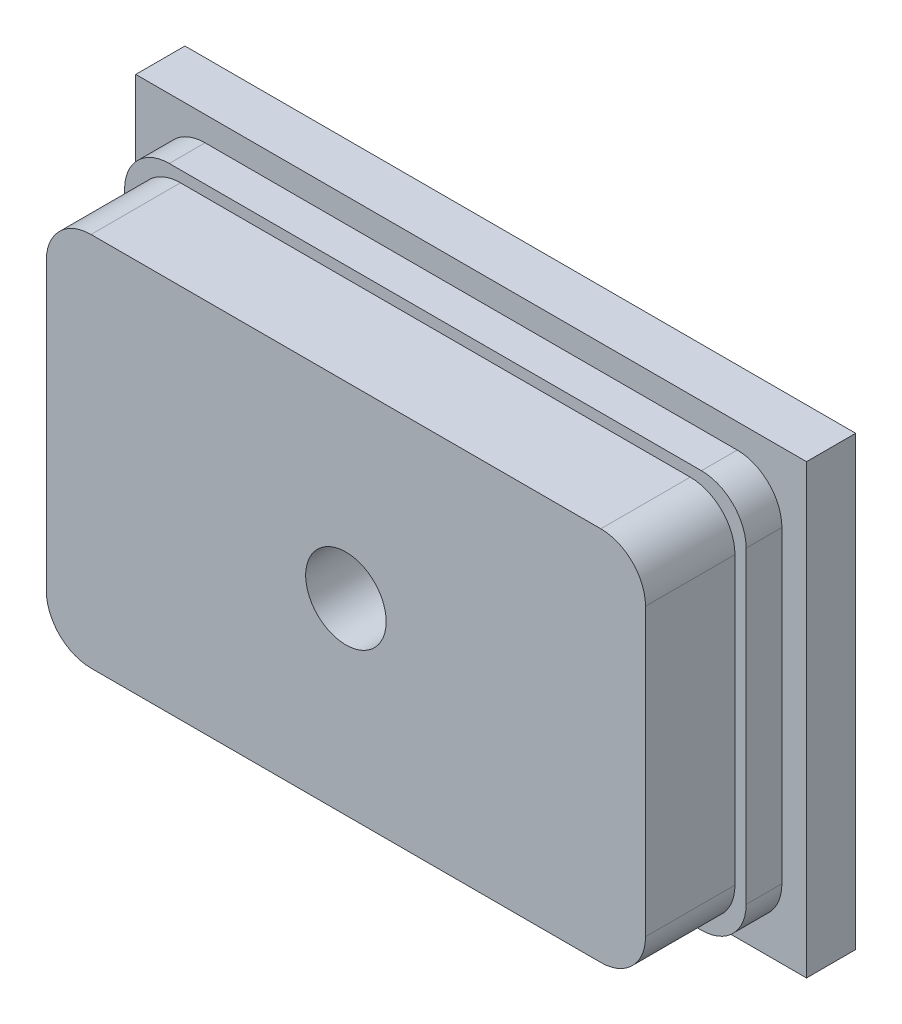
ISO-10303-21;
HEADER;
FILE_DESCRIPTION(('STEP AP214'),'2;1');
FILE_NAME('part.step','',(''),(''),'','','');
FILE_SCHEMA(('AUTOMOTIVE_DESIGN { 1 0 10303 214 1 1 1 1 }'));
ENDSEC;
DATA;
#1=APPLICATION_CONTEXT('core data for automotive mechanical design processes');
#2=APPLICATION_PROTOCOL_DEFINITION('international standard','automotive_design',2000,#1);
#3=PRODUCT_CONTEXT('',#1,'mechanical');
#4=PRODUCT('Part','Part','',(#3));
#5=PRODUCT_RELATED_PRODUCT_CATEGORY('part','',(#4));
#6=PRODUCT_DEFINITION_FORMATION('','',#4);
#7=PRODUCT_DEFINITION_CONTEXT('part definition',#1,'design');
#8=PRODUCT_DEFINITION('design','',#6,#7);
#9=PRODUCT_DEFINITION_SHAPE('','',#8);
#10=(LENGTH_UNIT() NAMED_UNIT(*) SI_UNIT(.MILLI.,.METRE.));
#11=(NAMED_UNIT(*) PLANE_ANGLE_UNIT() SI_UNIT($,.RADIAN.));
#12=(NAMED_UNIT(*) SI_UNIT($,.STERADIAN.) SOLID_ANGLE_UNIT());
#13=UNCERTAINTY_MEASURE_WITH_UNIT(LENGTH_MEASURE(1.E-05),#10,'distance_accuracy_value','');
#14=(GEOMETRIC_REPRESENTATION_CONTEXT(3) GLOBAL_UNCERTAINTY_ASSIGNED_CONTEXT((#13)) GLOBAL_UNIT_ASSIGNED_CONTEXT((#10,
#11,#12)) REPRESENTATION_CONTEXT('',''));
#15=CARTESIAN_POINT('',(0.,0.,0.));
#16=DIRECTION('',(0.,0.,1.));
#17=DIRECTION('',(1.,0.,0.));
#18=AXIS2_PLACEMENT_3D('',#15,#16,#17);
#19=CARTESIAN_POINT('',(-69.5,44.5,8.));
#20=DIRECTION('',(0.,0.,-1.));
#21=DIRECTION('',(-1.,0.,0.));
#22=AXIS2_PLACEMENT_3D('',#19,#20,#21);
#23=PLANE('',#22);
#24=DIRECTION('',(0.,1.,0.));
#25=VECTOR('',#24,1.);
#26=CARTESIAN_POINT('',(69.5,-44.5,8.));
#27=LINE('',#26,#25);
#28=CARTESIAN_POINT('',(69.5,-34.5,8.));
#29=VERTEX_POINT('',#28);
#30=CARTESIAN_POINT('',(69.5,34.5,8.));
#31=VERTEX_POINT('',#30);
#32=EDGE_CURVE('E256',#29,#31,#27,.T.);
#33=ORIENTED_EDGE('',*,*,#32,.T.);
#34=CARTESIAN_POINT('',(59.5,34.5,8.));
#35=DIRECTION('',(0.,0.,-1.));
#36=DIRECTION('',(-1.,0.,0.));
#37=AXIS2_PLACEMENT_3D('',#34,#35,#36);
#38=CIRCLE('',#37,10.);
#39=CARTESIAN_POINT('',(59.5,44.5,8.));
#40=VERTEX_POINT('',#39);
#41=EDGE_CURVE('E325',#31,#40,#38,.F.);
#42=ORIENTED_EDGE('',*,*,#41,.T.);
#43=DIRECTION('',(-1.,0.,0.));
#44=VECTOR('',#43,1.);
#45=CARTESIAN_POINT('',(-69.5,44.5,8.));
#46=LINE('',#45,#44);
#47=CARTESIAN_POINT('',(-59.5,44.5,8.));
#48=VERTEX_POINT('',#47);
#49=EDGE_CURVE('E259',#40,#48,#46,.T.);
#50=ORIENTED_EDGE('',*,*,#49,.T.);
#51=CARTESIAN_POINT('',(-59.5,34.5,8.));
#52=DIRECTION('',(0.,0.,-1.));
#53=DIRECTION('',(-1.,0.,0.));
#54=AXIS2_PLACEMENT_3D('',#51,#52,#53);
#55=CIRCLE('',#54,10.);
#56=CARTESIAN_POINT('',(-69.5,34.5,8.));
#57=VERTEX_POINT('',#56);
#58=EDGE_CURVE('E321',#48,#57,#55,.F.);
#59=ORIENTED_EDGE('',*,*,#58,.T.);
#60=DIRECTION('',(0.,-1.,0.));
#61=VECTOR('',#60,1.);
#62=CARTESIAN_POINT('',(-69.5,-44.5,8.));
#63=LINE('',#62,#61);
#64=CARTESIAN_POINT('',(-69.5,-34.5,8.));
#65=VERTEX_POINT('',#64);
#66=EDGE_CURVE('E252',#57,#65,#63,.T.);
#67=ORIENTED_EDGE('',*,*,#66,.T.);
#68=CARTESIAN_POINT('',(-59.5,-34.5,8.));
#69=DIRECTION('',(0.,0.,-1.));
#70=DIRECTION('',(-1.,0.,0.));
#71=AXIS2_PLACEMENT_3D('',#68,#69,#70);
#72=CIRCLE('',#71,10.);
#73=CARTESIAN_POINT('',(-59.5,-44.5,8.));
#74=VERTEX_POINT('',#73);
#75=EDGE_CURVE('E57',#65,#74,#72,.F.);
#76=ORIENTED_EDGE('',*,*,#75,.T.);
#77=DIRECTION('',(1.,0.,0.));
#78=VECTOR('',#77,1.);
#79=CARTESIAN_POINT('',(-69.5,-44.5,8.));
#80=LINE('',#79,#78);
#81=CARTESIAN_POINT('',(59.5,-44.5,8.));
#82=VERTEX_POINT('',#81);
#83=EDGE_CURVE('E254',#74,#82,#80,.T.);
#84=ORIENTED_EDGE('',*,*,#83,.T.);
#85=CARTESIAN_POINT('',(59.5,-34.5,8.));
#86=DIRECTION('',(0.,0.,-1.));
#87=DIRECTION('',(-1.,0.,0.));
#88=AXIS2_PLACEMENT_3D('',#85,#86,#87);
#89=CIRCLE('',#88,10.);
#90=EDGE_CURVE('E323',#82,#29,#89,.F.);
#91=ORIENTED_EDGE('',*,*,#90,.T.);
#92=EDGE_LOOP('',(#33,#42,#50,#59,#67,#76,#84,#91));
#93=FACE_BOUND('',#92,.T.);
#94=DIRECTION('',(0.,-1.,0.));
#95=VECTOR('',#94,1.);
#96=CARTESIAN_POINT('',(-67.,42.,8.));
#97=LINE('',#96,#95);
#98=CARTESIAN_POINT('',(-67.,32.,8.));
#99=VERTEX_POINT('',#98);
#100=CARTESIAN_POINT('',(-67.,-32.,8.));
#101=VERTEX_POINT('',#100);
#102=EDGE_CURVE('E191',#99,#101,#97,.T.);
#103=ORIENTED_EDGE('',*,*,#102,.F.);
#104=CARTESIAN_POINT('',(-57.,32.,8.));
#105=DIRECTION('',(0.,0.,-1.));
#106=DIRECTION('',(-1.,0.,0.));
#107=AXIS2_PLACEMENT_3D('',#104,#105,#106);
#108=CIRCLE('',#107,10.);
#109=CARTESIAN_POINT('',(-57.,42.,8.));
#110=VERTEX_POINT('',#109);
#111=EDGE_CURVE('E290',#99,#110,#108,.T.);
#112=ORIENTED_EDGE('',*,*,#111,.T.);
#113=DIRECTION('',(-1.,0.,0.));
#114=VECTOR('',#113,1.);
#115=CARTESIAN_POINT('',(-67.,42.,8.));
#116=LINE('',#115,#114);
#117=CARTESIAN_POINT('',(57.,42.,8.));
#118=VERTEX_POINT('',#117);
#119=EDGE_CURVE('E228',#118,#110,#116,.T.);
#120=ORIENTED_EDGE('',*,*,#119,.F.);
#121=CARTESIAN_POINT('',(57.,32.,8.));
#122=DIRECTION('',(0.,0.,-1.));
#123=DIRECTION('',(-1.,0.,0.));
#124=AXIS2_PLACEMENT_3D('',#121,#122,#123);
#125=CIRCLE('',#124,10.);
#126=CARTESIAN_POINT('',(67.,32.,8.));
#127=VERTEX_POINT('',#126);
#128=EDGE_CURVE('E294',#118,#127,#125,.T.);
#129=ORIENTED_EDGE('',*,*,#128,.T.);
#130=DIRECTION('',(0.,1.,0.));
#131=VECTOR('',#130,1.);
#132=CARTESIAN_POINT('',(67.,42.,8.));
#133=LINE('',#132,#131);
#134=CARTESIAN_POINT('',(67.,-32.,8.));
#135=VERTEX_POINT('',#134);
#136=EDGE_CURVE('E225',#135,#127,#133,.T.);
#137=ORIENTED_EDGE('',*,*,#136,.F.);
#138=CARTESIAN_POINT('',(57.,-32.,8.));
#139=DIRECTION('',(0.,0.,-1.));
#140=DIRECTION('',(-1.,0.,0.));
#141=AXIS2_PLACEMENT_3D('',#138,#139,#140);
#142=CIRCLE('',#141,10.);
#143=CARTESIAN_POINT('',(57.,-42.,8.));
#144=VERTEX_POINT('',#143);
#145=EDGE_CURVE('E296',#135,#144,#142,.T.);
#146=ORIENTED_EDGE('',*,*,#145,.T.);
#147=DIRECTION('',(1.,0.,0.));
#148=VECTOR('',#147,1.);
#149=CARTESIAN_POINT('',(-67.,-42.,8.));
#150=LINE('',#149,#148);
#151=CARTESIAN_POINT('',(-57.,-42.,8.));
#152=VERTEX_POINT('',#151);
#153=EDGE_CURVE('E222',#152,#144,#150,.T.);
#154=ORIENTED_EDGE('',*,*,#153,.F.);
#155=CARTESIAN_POINT('',(-57.,-32.,8.));
#156=DIRECTION('',(0.,0.,-1.));
#157=DIRECTION('',(-1.,0.,0.));
#158=AXIS2_PLACEMENT_3D('',#155,#156,#157);
#159=CIRCLE('',#158,10.);
#160=EDGE_CURVE('E292',#152,#101,#159,.T.);
#161=ORIENTED_EDGE('',*,*,#160,.T.);
#162=EDGE_LOOP('',(#103,#112,#120,#129,#137,#146,#154,#161));
#163=FACE_BOUND('',#162,.T.);
#164=ADVANCED_FACE('F35',(#93,#163),#23,.F.);
#165=CARTESIAN_POINT('',(-69.5,-44.5,8.));
#166=DIRECTION('',(1.,0.,0.));
#167=DIRECTION('',(0.,0.,-1.));
#168=AXIS2_PLACEMENT_3D('',#165,#166,#167);
#169=PLANE('',#168);
#170=ORIENTED_EDGE('',*,*,#66,.F.);
#171=DIRECTION('',(0.,0.,-1.));
#172=VECTOR('',#171,1.);
#173=CARTESIAN_POINT('',(-69.5,34.5,8.));
#174=LINE('',#173,#172);
#175=CARTESIAN_POINT('',(-69.5,34.5,0.));
#176=VERTEX_POINT('',#175);
#177=EDGE_CURVE('E11',#57,#176,#174,.T.);
#178=ORIENTED_EDGE('',*,*,#177,.T.);
#179=DIRECTION('',(0.,-1.,0.));
#180=VECTOR('',#179,1.);
#181=CARTESIAN_POINT('',(-69.5,-44.5,0.));
#182=LINE('',#181,#180);
#183=CARTESIAN_POINT('',(-69.5,-34.5,0.));
#184=VERTEX_POINT('',#183);
#185=EDGE_CURVE('E243',#176,#184,#182,.T.);
#186=ORIENTED_EDGE('',*,*,#185,.T.);
#187=DIRECTION('',(0.,0.,-1.));
#188=VECTOR('',#187,1.);
#189=CARTESIAN_POINT('',(-69.5,-34.5,8.));
#190=LINE('',#189,#188);
#191=EDGE_CURVE('E43',#184,#65,#190,.F.);
#192=ORIENTED_EDGE('',*,*,#191,.T.);
#193=EDGE_LOOP('',(#170,#178,#186,#192));
#194=FACE_BOUND('',#193,.T.);
#195=ADVANCED_FACE('F37',(#194),#169,.F.);
#196=CARTESIAN_POINT('',(-69.5,-44.5,8.));
#197=DIRECTION('',(0.,1.,0.));
#198=DIRECTION('',(0.,0.,1.));
#199=AXIS2_PLACEMENT_3D('',#196,#197,#198);
#200=PLANE('',#199);
#201=DIRECTION('',(1.,0.,0.));
#202=VECTOR('',#201,1.);
#203=CARTESIAN_POINT('',(-69.5,-44.5,0.));
#204=LINE('',#203,#202);
#205=CARTESIAN_POINT('',(-59.5,-44.5,0.));
#206=VERTEX_POINT('',#205);
#207=CARTESIAN_POINT('',(59.5,-44.5,0.));
#208=VERTEX_POINT('',#207);
#209=EDGE_CURVE('E246',#206,#208,#204,.T.);
#210=ORIENTED_EDGE('',*,*,#209,.T.);
#211=DIRECTION('',(0.,0.,-1.));
#212=VECTOR('',#211,1.);
#213=CARTESIAN_POINT('',(59.5,-44.5,8.));
#214=LINE('',#213,#212);
#215=EDGE_CURVE('E50',#208,#82,#214,.F.);
#216=ORIENTED_EDGE('',*,*,#215,.T.);
#217=ORIENTED_EDGE('',*,*,#83,.F.);
#218=DIRECTION('',(0.,0.,-1.));
#219=VECTOR('',#218,1.);
#220=CARTESIAN_POINT('',(-59.5,-44.5,8.));
#221=LINE('',#220,#219);
#222=EDGE_CURVE('E327',#74,#206,#221,.T.);
#223=ORIENTED_EDGE('',*,*,#222,.T.);
#224=EDGE_LOOP('',(#210,#216,#217,#223));
#225=FACE_BOUND('',#224,.T.);
#226=ADVANCED_FACE('F340',(#225),#200,.F.);
#227=CARTESIAN_POINT('',(69.5,-44.5,8.));
#228=DIRECTION('',(-1.,0.,0.));
#229=DIRECTION('',(0.,0.,1.));
#230=AXIS2_PLACEMENT_3D('',#227,#228,#229);
#231=PLANE('',#230);
#232=DIRECTION('',(0.,1.,0.));
#233=VECTOR('',#232,1.);
#234=CARTESIAN_POINT('',(69.5,-44.5,0.));
#235=LINE('',#234,#233);
#236=CARTESIAN_POINT('',(69.5,-34.5,0.));
#237=VERTEX_POINT('',#236);
#238=CARTESIAN_POINT('',(69.5,34.5,0.));
#239=VERTEX_POINT('',#238);
#240=EDGE_CURVE('E248',#237,#239,#235,.T.);
#241=ORIENTED_EDGE('',*,*,#240,.T.);
#242=DIRECTION('',(0.,0.,-1.));
#243=VECTOR('',#242,1.);
#244=CARTESIAN_POINT('',(69.5,34.5,8.));
#245=LINE('',#244,#243);
#246=EDGE_CURVE('E318',#239,#31,#245,.F.);
#247=ORIENTED_EDGE('',*,*,#246,.T.);
#248=ORIENTED_EDGE('',*,*,#32,.F.);
#249=DIRECTION('',(0.,0.,-1.));
#250=VECTOR('',#249,1.);
#251=CARTESIAN_POINT('',(69.5,-34.5,8.));
#252=LINE('',#251,#250);
#253=EDGE_CURVE('E315',#29,#237,#252,.T.);
#254=ORIENTED_EDGE('',*,*,#253,.T.);
#255=EDGE_LOOP('',(#241,#247,#248,#254));
#256=FACE_BOUND('',#255,.T.);
#257=ADVANCED_FACE('F349',(#256),#231,.F.);
#258=CARTESIAN_POINT('',(-69.5,44.5,8.));
#259=DIRECTION('',(0.,-1.,0.));
#260=DIRECTION('',(0.,0.,-1.));
#261=AXIS2_PLACEMENT_3D('',#258,#259,#260);
#262=PLANE('',#261);
#263=ORIENTED_EDGE('',*,*,#49,.F.);
#264=DIRECTION('',(0.,0.,-1.));
#265=VECTOR('',#264,1.);
#266=CARTESIAN_POINT('',(59.5,44.5,8.));
#267=LINE('',#266,#265);
#268=CARTESIAN_POINT('',(59.5,44.5,0.));
#269=VERTEX_POINT('',#268);
#270=EDGE_CURVE('E300',#40,#269,#267,.T.);
#271=ORIENTED_EDGE('',*,*,#270,.T.);
#272=DIRECTION('',(-1.,0.,0.));
#273=VECTOR('',#272,1.);
#274=CARTESIAN_POINT('',(-69.5,44.5,0.));
#275=LINE('',#274,#273);
#276=CARTESIAN_POINT('',(-59.5,44.5,0.));
#277=VERTEX_POINT('',#276);
#278=EDGE_CURVE('E250',#269,#277,#275,.T.);
#279=ORIENTED_EDGE('',*,*,#278,.T.);
#280=DIRECTION('',(0.,0.,-1.));
#281=VECTOR('',#280,1.);
#282=CARTESIAN_POINT('',(-59.5,44.5,8.));
#283=LINE('',#282,#281);
#284=EDGE_CURVE('E298',#277,#48,#283,.F.);
#285=ORIENTED_EDGE('',*,*,#284,.T.);
#286=EDGE_LOOP('',(#263,#271,#279,#285));
#287=FACE_BOUND('',#286,.T.);
#288=ADVANCED_FACE('F358',(#287),#262,.F.);
#289=CARTESIAN_POINT('',(-67.,42.,28.));
#290=DIRECTION('',(1.,0.,0.));
#291=DIRECTION('',(0.,1.,0.));
#292=AXIS2_PLACEMENT_3D('',#289,#290,#291);
#293=PLANE('',#292);
#294=DIRECTION('',(0.,-1.,0.));
#295=VECTOR('',#294,1.);
#296=CARTESIAN_POINT('',(-67.,42.,28.));
#297=LINE('',#296,#295);
#298=CARTESIAN_POINT('',(-67.,32.,28.));
#299=VERTEX_POINT('',#298);
#300=CARTESIAN_POINT('',(-67.,-32.,28.));
#301=VERTEX_POINT('',#300);
#302=EDGE_CURVE('E231',#299,#301,#297,.T.);
#303=ORIENTED_EDGE('',*,*,#302,.F.);
#304=DIRECTION('',(0.,0.,-1.));
#305=VECTOR('',#304,1.);
#306=CARTESIAN_POINT('',(-67.,32.,28.));
#307=LINE('',#306,#305);
#308=EDGE_CURVE('E264',#299,#99,#307,.T.);
#309=ORIENTED_EDGE('',*,*,#308,.T.);
#310=ORIENTED_EDGE('',*,*,#102,.T.);
#311=DIRECTION('',(0.,0.,-1.));
#312=VECTOR('',#311,1.);
#313=CARTESIAN_POINT('',(-67.,-32.,28.));
#314=LINE('',#313,#312);
#315=EDGE_CURVE('E262',#101,#301,#314,.F.);
#316=ORIENTED_EDGE('',*,*,#315,.T.);
#317=EDGE_LOOP('',(#303,#309,#310,#316));
#318=FACE_BOUND('',#317,.T.);
#319=ADVANCED_FACE('F377',(#318),#293,.F.);
#320=CARTESIAN_POINT('',(-67.,-42.,28.));
#321=DIRECTION('',(0.,1.,0.));
#322=DIRECTION('',(-1.,0.,0.));
#323=AXIS2_PLACEMENT_3D('',#320,#321,#322);
#324=PLANE('',#323);
#325=DIRECTION('',(1.,0.,0.));
#326=VECTOR('',#325,1.);
#327=CARTESIAN_POINT('',(-67.,-42.,28.));
#328=LINE('',#327,#326);
#329=CARTESIAN_POINT('',(-57.,-42.,28.));
#330=VERTEX_POINT('',#329);
#331=CARTESIAN_POINT('',(57.,-42.,28.));
#332=VERTEX_POINT('',#331);
#333=EDGE_CURVE('E234',#330,#332,#328,.T.);
#334=ORIENTED_EDGE('',*,*,#333,.F.);
#335=DIRECTION('',(0.,0.,-1.));
#336=VECTOR('',#335,1.);
#337=CARTESIAN_POINT('',(-57.,-42.,28.));
#338=LINE('',#337,#336);
#339=EDGE_CURVE('E282',#330,#152,#338,.T.);
#340=ORIENTED_EDGE('',*,*,#339,.T.);
#341=ORIENTED_EDGE('',*,*,#153,.T.);
#342=DIRECTION('',(0.,0.,-1.));
#343=VECTOR('',#342,1.);
#344=CARTESIAN_POINT('',(57.,-42.,28.));
#345=LINE('',#344,#343);
#346=EDGE_CURVE('E280',#144,#332,#345,.F.);
#347=ORIENTED_EDGE('',*,*,#346,.T.);
#348=EDGE_LOOP('',(#334,#340,#341,#347));
#349=FACE_BOUND('',#348,.T.);
#350=ADVANCED_FACE('F402',(#349),#324,.F.);
#351=CARTESIAN_POINT('',(67.,42.,28.));
#352=DIRECTION('',(-1.,0.,0.));
#353=DIRECTION('',(0.,-1.,0.));
#354=AXIS2_PLACEMENT_3D('',#351,#352,#353);
#355=PLANE('',#354);
#356=ORIENTED_EDGE('',*,*,#136,.T.);
#357=DIRECTION('',(0.,0.,-1.));
#358=VECTOR('',#357,1.);
#359=CARTESIAN_POINT('',(67.,32.,28.));
#360=LINE('',#359,#358);
#361=CARTESIAN_POINT('',(67.,32.,28.));
#362=VERTEX_POINT('',#361);
#363=EDGE_CURVE('E288',#127,#362,#360,.F.);
#364=ORIENTED_EDGE('',*,*,#363,.T.);
#365=DIRECTION('',(0.,1.,0.));
#366=VECTOR('',#365,1.);
#367=CARTESIAN_POINT('',(67.,42.,28.));
#368=LINE('',#367,#366);
#369=CARTESIAN_POINT('',(67.,-32.,28.));
#370=VERTEX_POINT('',#369);
#371=EDGE_CURVE('E237',#370,#362,#368,.T.);
#372=ORIENTED_EDGE('',*,*,#371,.F.);
#373=DIRECTION('',(0.,0.,-1.));
#374=VECTOR('',#373,1.);
#375=CARTESIAN_POINT('',(67.,-32.,28.));
#376=LINE('',#375,#374);
#377=EDGE_CURVE('E285',#370,#135,#376,.T.);
#378=ORIENTED_EDGE('',*,*,#377,.T.);
#379=EDGE_LOOP('',(#356,#364,#372,#378));
#380=FACE_BOUND('',#379,.T.);
#381=ADVANCED_FACE('F409',(#380),#355,.F.);
#382=CARTESIAN_POINT('',(-67.,42.,28.));
#383=DIRECTION('',(0.,-1.,0.));
#384=DIRECTION('',(0.,0.,-1.));
#385=AXIS2_PLACEMENT_3D('',#382,#383,#384);
#386=PLANE('',#385);
#387=ORIENTED_EDGE('',*,*,#119,.T.);
#388=DIRECTION('',(0.,0.,-1.));
#389=VECTOR('',#388,1.);
#390=CARTESIAN_POINT('',(-57.,42.,28.));
#391=LINE('',#390,#389);
#392=CARTESIAN_POINT('',(-57.,42.,28.));
#393=VERTEX_POINT('',#392);
#394=EDGE_CURVE('E270',#110,#393,#391,.F.);
#395=ORIENTED_EDGE('',*,*,#394,.T.);
#396=DIRECTION('',(-1.,0.,0.));
#397=VECTOR('',#396,1.);
#398=CARTESIAN_POINT('',(-67.,42.,28.));
#399=LINE('',#398,#397);
#400=CARTESIAN_POINT('',(57.,42.,28.));
#401=VERTEX_POINT('',#400);
#402=EDGE_CURVE('E240',#401,#393,#399,.T.);
#403=ORIENTED_EDGE('',*,*,#402,.F.);
#404=DIRECTION('',(0.,0.,-1.));
#405=VECTOR('',#404,1.);
#406=CARTESIAN_POINT('',(57.,42.,28.));
#407=LINE('',#406,#405);
#408=EDGE_CURVE('E267',#401,#118,#407,.T.);
#409=ORIENTED_EDGE('',*,*,#408,.T.);
#410=EDGE_LOOP('',(#387,#395,#403,#409));
#411=FACE_BOUND('',#410,.T.);
#412=ADVANCED_FACE('F416',(#411),#386,.F.);
#413=CARTESIAN_POINT('',(-67.,42.,28.));
#414=DIRECTION('',(0.,0.,1.));
#415=DIRECTION('',(1.,0.,0.));
#416=AXIS2_PLACEMENT_3D('',#413,#414,#415);
#417=PLANE('',#416);
#418=CARTESIAN_POINT('',(0.,0.,28.));
#419=DIRECTION('',(0.,0.,1.));
#420=DIRECTION('',(1.,0.,0.));
#421=AXIS2_PLACEMENT_3D('',#418,#419,#420);
#422=CIRCLE('',#421,9.);
#423=CARTESIAN_POINT('',(9.,0.,28.));
#424=VERTEX_POINT('',#423);
#425=EDGE_CURVE('E201',#424,#424,#422,.T.);
#426=ORIENTED_EDGE('',*,*,#425,.F.);
#427=EDGE_LOOP('',(#426));
#428=FACE_BOUND('',#427,.T.);
#429=ORIENTED_EDGE('',*,*,#402,.T.);
#430=CARTESIAN_POINT('',(-57.,32.,28.));
#431=DIRECTION('',(0.,0.,1.));
#432=DIRECTION('',(1.,0.,0.));
#433=AXIS2_PLACEMENT_3D('',#430,#431,#432);
#434=CIRCLE('',#433,10.);
#435=EDGE_CURVE('E278',#393,#299,#434,.T.);
#436=ORIENTED_EDGE('',*,*,#435,.T.);
#437=ORIENTED_EDGE('',*,*,#302,.T.);
#438=CARTESIAN_POINT('',(-57.,-32.,28.));
#439=DIRECTION('',(0.,0.,1.));
#440=DIRECTION('',(1.,0.,0.));
#441=AXIS2_PLACEMENT_3D('',#438,#439,#440);
#442=CIRCLE('',#441,10.);
#443=EDGE_CURVE('E276',#301,#330,#442,.T.);
#444=ORIENTED_EDGE('',*,*,#443,.T.);
#445=ORIENTED_EDGE('',*,*,#333,.T.);
#446=CARTESIAN_POINT('',(57.,-32.,28.));
#447=DIRECTION('',(0.,0.,1.));
#448=DIRECTION('',(1.,0.,0.));
#449=AXIS2_PLACEMENT_3D('',#446,#447,#448);
#450=CIRCLE('',#449,10.);
#451=EDGE_CURVE('E272',#332,#370,#450,.T.);
#452=ORIENTED_EDGE('',*,*,#451,.T.);
#453=ORIENTED_EDGE('',*,*,#371,.T.);
#454=CARTESIAN_POINT('',(57.,32.,28.));
#455=DIRECTION('',(0.,0.,1.));
#456=DIRECTION('',(1.,0.,0.));
#457=AXIS2_PLACEMENT_3D('',#454,#455,#456);
#458=CIRCLE('',#457,10.);
#459=EDGE_CURVE('E274',#362,#401,#458,.T.);
#460=ORIENTED_EDGE('',*,*,#459,.T.);
#461=EDGE_LOOP('',(#429,#436,#437,#444,#445,#452,#453,#460));
#462=FACE_BOUND('',#461,.T.);
#463=ADVANCED_FACE('F424',(#428,#462),#417,.T.);
#464=CARTESIAN_POINT('',(-57.,32.,28.));
#465=DIRECTION('',(0.,0.,-1.));
#466=DIRECTION('',(-1.,0.,0.));
#467=AXIS2_PLACEMENT_3D('',#464,#465,#466);
#468=CYLINDRICAL_SURFACE('',#467,10.);
#469=ORIENTED_EDGE('',*,*,#435,.F.);
#470=ORIENTED_EDGE('',*,*,#394,.F.);
#471=ORIENTED_EDGE('',*,*,#111,.F.);
#472=ORIENTED_EDGE('',*,*,#308,.F.);
#473=EDGE_LOOP('',(#469,#470,#471,#472));
#474=FACE_BOUND('',#473,.T.);
#475=ADVANCED_FACE('F433',(#474),#468,.T.);
#476=CARTESIAN_POINT('',(-57.,-32.,28.));
#477=DIRECTION('',(0.,0.,-1.));
#478=DIRECTION('',(-1.,0.,0.));
#479=AXIS2_PLACEMENT_3D('',#476,#477,#478);
#480=CYLINDRICAL_SURFACE('',#479,10.);
#481=ORIENTED_EDGE('',*,*,#443,.F.);
#482=ORIENTED_EDGE('',*,*,#315,.F.);
#483=ORIENTED_EDGE('',*,*,#160,.F.);
#484=ORIENTED_EDGE('',*,*,#339,.F.);
#485=EDGE_LOOP('',(#481,#482,#483,#484));
#486=FACE_BOUND('',#485,.T.);
#487=ADVANCED_FACE('F442',(#486),#480,.T.);
#488=CARTESIAN_POINT('',(57.,32.,28.));
#489=DIRECTION('',(0.,0.,-1.));
#490=DIRECTION('',(-1.,0.,0.));
#491=AXIS2_PLACEMENT_3D('',#488,#489,#490);
#492=CYLINDRICAL_SURFACE('',#491,10.);
#493=ORIENTED_EDGE('',*,*,#459,.F.);
#494=ORIENTED_EDGE('',*,*,#363,.F.);
#495=ORIENTED_EDGE('',*,*,#128,.F.);
#496=ORIENTED_EDGE('',*,*,#408,.F.);
#497=EDGE_LOOP('',(#493,#494,#495,#496));
#498=FACE_BOUND('',#497,.T.);
#499=ADVANCED_FACE('F450',(#498),#492,.T.);
#500=CARTESIAN_POINT('',(57.,-32.,28.));
#501=DIRECTION('',(0.,0.,-1.));
#502=DIRECTION('',(-1.,0.,0.));
#503=AXIS2_PLACEMENT_3D('',#500,#501,#502);
#504=CYLINDRICAL_SURFACE('',#503,10.);
#505=ORIENTED_EDGE('',*,*,#451,.F.);
#506=ORIENTED_EDGE('',*,*,#346,.F.);
#507=ORIENTED_EDGE('',*,*,#145,.F.);
#508=ORIENTED_EDGE('',*,*,#377,.F.);
#509=EDGE_LOOP('',(#505,#506,#507,#508));
#510=FACE_BOUND('',#509,.T.);
#511=ADVANCED_FACE('F458',(#510),#504,.T.);
#512=CARTESIAN_POINT('',(59.5,34.5,8.));
#513=DIRECTION('',(0.,0.,-1.));
#514=DIRECTION('',(-1.,0.,0.));
#515=AXIS2_PLACEMENT_3D('',#512,#513,#514);
#516=CYLINDRICAL_SURFACE('',#515,10.);
#517=ORIENTED_EDGE('',*,*,#41,.F.);
#518=ORIENTED_EDGE('',*,*,#246,.F.);
#519=CARTESIAN_POINT('',(59.5,34.5,0.));
#520=DIRECTION('',(0.,0.,-1.));
#521=DIRECTION('',(-1.,0.,0.));
#522=AXIS2_PLACEMENT_3D('',#519,#520,#521);
#523=CIRCLE('',#522,10.);
#524=EDGE_CURVE('E312',#269,#239,#523,.T.);
#525=ORIENTED_EDGE('',*,*,#524,.F.);
#526=ORIENTED_EDGE('',*,*,#270,.F.);
#527=EDGE_LOOP('',(#517,#518,#525,#526));
#528=FACE_BOUND('',#527,.T.);
#529=ADVANCED_FACE('F355',(#528),#516,.T.);
#530=CARTESIAN_POINT('',(59.5,-34.5,8.));
#531=DIRECTION('',(0.,0.,-1.));
#532=DIRECTION('',(-1.,0.,0.));
#533=AXIS2_PLACEMENT_3D('',#530,#531,#532);
#534=CYLINDRICAL_SURFACE('',#533,10.);
#535=ORIENTED_EDGE('',*,*,#90,.F.);
#536=ORIENTED_EDGE('',*,*,#215,.F.);
#537=CARTESIAN_POINT('',(59.5,-34.5,0.));
#538=DIRECTION('',(0.,0.,-1.));
#539=DIRECTION('',(-1.,0.,0.));
#540=AXIS2_PLACEMENT_3D('',#537,#538,#539);
#541=CIRCLE('',#540,10.);
#542=EDGE_CURVE('E309',#237,#208,#541,.T.);
#543=ORIENTED_EDGE('',*,*,#542,.F.);
#544=ORIENTED_EDGE('',*,*,#253,.F.);
#545=EDGE_LOOP('',(#535,#536,#543,#544));
#546=FACE_BOUND('',#545,.T.);
#547=ADVANCED_FACE('F346',(#546),#534,.T.);
#548=CARTESIAN_POINT('',(-59.5,34.5,8.));
#549=DIRECTION('',(0.,0.,-1.));
#550=DIRECTION('',(-1.,0.,0.));
#551=AXIS2_PLACEMENT_3D('',#548,#549,#550);
#552=CYLINDRICAL_SURFACE('',#551,10.);
#553=ORIENTED_EDGE('',*,*,#58,.F.);
#554=ORIENTED_EDGE('',*,*,#284,.F.);
#555=CARTESIAN_POINT('',(-59.5,34.5,0.));
#556=DIRECTION('',(0.,0.,-1.));
#557=DIRECTION('',(-1.,0.,0.));
#558=AXIS2_PLACEMENT_3D('',#555,#556,#557);
#559=CIRCLE('',#558,10.);
#560=EDGE_CURVE('E306',#176,#277,#559,.T.);
#561=ORIENTED_EDGE('',*,*,#560,.F.);
#562=ORIENTED_EDGE('',*,*,#177,.F.);
#563=EDGE_LOOP('',(#553,#554,#561,#562));
#564=FACE_BOUND('',#563,.T.);
#565=ADVANCED_FACE('F361',(#564),#552,.T.);
#566=CARTESIAN_POINT('',(-59.5,-34.5,8.));
#567=DIRECTION('',(0.,0.,-1.));
#568=DIRECTION('',(-1.,0.,0.));
#569=AXIS2_PLACEMENT_3D('',#566,#567,#568);
#570=CYLINDRICAL_SURFACE('',#569,10.);
#571=ORIENTED_EDGE('',*,*,#75,.F.);
#572=ORIENTED_EDGE('',*,*,#191,.F.);
#573=CARTESIAN_POINT('',(-59.5,-34.5,0.));
#574=DIRECTION('',(0.,0.,-1.));
#575=DIRECTION('',(-1.,0.,0.));
#576=AXIS2_PLACEMENT_3D('',#573,#574,#575);
#577=CIRCLE('',#576,10.);
#578=EDGE_CURVE('E303',#206,#184,#577,.T.);
#579=ORIENTED_EDGE('',*,*,#578,.F.);
#580=ORIENTED_EDGE('',*,*,#222,.F.);
#581=EDGE_LOOP('',(#571,#572,#579,#580));
#582=FACE_BOUND('',#581,.T.);
#583=ADVANCED_FACE('F338',(#582),#570,.T.);
#584=CARTESIAN_POINT('',(-75.,-50.,-11.));
#585=DIRECTION('',(1.,0.,0.));
#586=DIRECTION('',(0.,0.,-1.));
#587=AXIS2_PLACEMENT_3D('',#584,#585,#586);
#588=PLANE('',#587);
#589=DIRECTION('',(0.,1.,0.));
#590=VECTOR('',#589,1.);
#591=CARTESIAN_POINT('',(-75.,-50.,0.));
#592=LINE('',#591,#590);
#593=CARTESIAN_POINT('',(-75.,-50.,0.));
#594=VERTEX_POINT('',#593);
#595=CARTESIAN_POINT('',(-75.,50.,0.));
#596=VERTEX_POINT('',#595);
#597=EDGE_CURVE('E178',#594,#596,#592,.T.);
#598=ORIENTED_EDGE('',*,*,#597,.T.);
#599=DIRECTION('',(0.,0.,1.));
#600=VECTOR('',#599,1.);
#601=CARTESIAN_POINT('',(-75.,50.,-11.));
#602=LINE('',#601,#600);
#603=CARTESIAN_POINT('',(-75.,50.,-11.));
#604=VERTEX_POINT('',#603);
#605=EDGE_CURVE('E185',#604,#596,#602,.T.);
#606=ORIENTED_EDGE('',*,*,#605,.F.);
#607=DIRECTION('',(0.,1.,0.));
#608=VECTOR('',#607,1.);
#609=CARTESIAN_POINT('',(-75.,-50.,-11.));
#610=LINE('',#609,#608);
#611=CARTESIAN_POINT('',(-75.,-50.,-11.));
#612=VERTEX_POINT('',#611);
#613=EDGE_CURVE('E208',#612,#604,#610,.T.);
#614=ORIENTED_EDGE('',*,*,#613,.F.);
#615=DIRECTION('',(0.,0.,1.));
#616=VECTOR('',#615,1.);
#617=CARTESIAN_POINT('',(-75.,-50.,-11.));
#618=LINE('',#617,#616);
#619=EDGE_CURVE('E197',#612,#594,#618,.T.);
#620=ORIENTED_EDGE('',*,*,#619,.T.);
#621=EDGE_LOOP('',(#598,#606,#614,#620));
#622=FACE_BOUND('',#621,.T.);
#623=ADVANCED_FACE('F195',(#622),#588,.F.);
#624=CARTESIAN_POINT('',(-75.,50.,-11.));
#625=DIRECTION('',(0.,-1.,0.));
#626=DIRECTION('',(1.,0.,0.));
#627=AXIS2_PLACEMENT_3D('',#624,#625,#626);
#628=PLANE('',#627);
#629=DIRECTION('',(1.,0.,0.));
#630=VECTOR('',#629,1.);
#631=CARTESIAN_POINT('',(-75.,50.,0.));
#632=LINE('',#631,#630);
#633=CARTESIAN_POINT('',(75.,50.,0.));
#634=VERTEX_POINT('',#633);
#635=EDGE_CURVE('E173',#596,#634,#632,.T.);
#636=ORIENTED_EDGE('',*,*,#635,.T.);
#637=DIRECTION('',(0.,0.,1.));
#638=VECTOR('',#637,1.);
#639=CARTESIAN_POINT('',(75.,50.,-11.));
#640=LINE('',#639,#638);
#641=CARTESIAN_POINT('',(75.,50.,-11.));
#642=VERTEX_POINT('',#641);
#643=EDGE_CURVE('E192',#642,#634,#640,.T.);
#644=ORIENTED_EDGE('',*,*,#643,.F.);
#645=DIRECTION('',(1.,0.,0.));
#646=VECTOR('',#645,1.);
#647=CARTESIAN_POINT('',(-75.,50.,-11.));
#648=LINE('',#647,#646);
#649=EDGE_CURVE('E187',#604,#642,#648,.T.);
#650=ORIENTED_EDGE('',*,*,#649,.F.);
#651=ORIENTED_EDGE('',*,*,#605,.T.);
#652=EDGE_LOOP('',(#636,#644,#650,#651));
#653=FACE_BOUND('',#652,.T.);
#654=ADVANCED_FACE('F186',(#653),#628,.F.);
#655=CARTESIAN_POINT('',(75.,-50.,-11.));
#656=DIRECTION('',(-1.,0.,0.));
#657=DIRECTION('',(0.,0.,1.));
#658=AXIS2_PLACEMENT_3D('',#655,#656,#657);
#659=PLANE('',#658);
#660=DIRECTION('',(0.,-1.,0.));
#661=VECTOR('',#660,1.);
#662=CARTESIAN_POINT('',(75.,-50.,0.));
#663=LINE('',#662,#661);
#664=CARTESIAN_POINT('',(75.,-50.,0.));
#665=VERTEX_POINT('',#664);
#666=EDGE_CURVE('E179',#634,#665,#663,.T.);
#667=ORIENTED_EDGE('',*,*,#666,.T.);
#668=DIRECTION('',(0.,0.,1.));
#669=VECTOR('',#668,1.);
#670=CARTESIAN_POINT('',(75.,-50.,-11.));
#671=LINE('',#670,#669);
#672=CARTESIAN_POINT('',(75.,-50.,-11.));
#673=VERTEX_POINT('',#672);
#674=EDGE_CURVE('E216',#673,#665,#671,.T.);
#675=ORIENTED_EDGE('',*,*,#674,.F.);
#676=DIRECTION('',(0.,-1.,0.));
#677=VECTOR('',#676,1.);
#678=CARTESIAN_POINT('',(75.,-50.,-11.));
#679=LINE('',#678,#677);
#680=EDGE_CURVE('E211',#642,#673,#679,.T.);
#681=ORIENTED_EDGE('',*,*,#680,.F.);
#682=ORIENTED_EDGE('',*,*,#643,.T.);
#683=EDGE_LOOP('',(#667,#675,#681,#682));
#684=FACE_BOUND('',#683,.T.);
#685=ADVANCED_FACE('F503',(#684),#659,.F.);
#686=CARTESIAN_POINT('',(-75.,-50.,-11.));
#687=DIRECTION('',(0.,1.,0.));
#688=DIRECTION('',(-1.,0.,0.));
#689=AXIS2_PLACEMENT_3D('',#686,#687,#688);
#690=PLANE('',#689);
#691=DIRECTION('',(-1.,0.,0.));
#692=VECTOR('',#691,1.);
#693=CARTESIAN_POINT('',(-75.,-50.,0.));
#694=LINE('',#693,#692);
#695=EDGE_CURVE('E206',#665,#594,#694,.T.);
#696=ORIENTED_EDGE('',*,*,#695,.T.);
#697=ORIENTED_EDGE('',*,*,#619,.F.);
#698=DIRECTION('',(-1.,0.,0.));
#699=VECTOR('',#698,1.);
#700=CARTESIAN_POINT('',(-75.,-50.,-11.));
#701=LINE('',#700,#699);
#702=EDGE_CURVE('E213',#673,#612,#701,.T.);
#703=ORIENTED_EDGE('',*,*,#702,.F.);
#704=ORIENTED_EDGE('',*,*,#674,.T.);
#705=EDGE_LOOP('',(#696,#697,#703,#704));
#706=FACE_BOUND('',#705,.T.);
#707=ADVANCED_FACE('F512',(#706),#690,.F.);
#708=CARTESIAN_POINT('',(-75.,50.,-11.));
#709=DIRECTION('',(0.,0.,-1.));
#710=DIRECTION('',(-1.,0.,0.));
#711=AXIS2_PLACEMENT_3D('',#708,#709,#710);
#712=PLANE('',#711);
#713=ORIENTED_EDGE('',*,*,#613,.T.);
#714=ORIENTED_EDGE('',*,*,#649,.T.);
#715=ORIENTED_EDGE('',*,*,#680,.T.);
#716=ORIENTED_EDGE('',*,*,#702,.T.);
#717=EDGE_LOOP('',(#713,#714,#715,#716));
#718=FACE_BOUND('',#717,.T.);
#719=ADVANCED_FACE('F522',(#718),#712,.T.);
#720=CARTESIAN_POINT('',(-75.,50.,0.));
#721=DIRECTION('',(0.,0.,-1.));
#722=DIRECTION('',(-1.,0.,0.));
#723=AXIS2_PLACEMENT_3D('',#720,#721,#722);
#724=PLANE('',#723);
#725=ORIENTED_EDGE('',*,*,#524,.T.);
#726=ORIENTED_EDGE('',*,*,#240,.F.);
#727=ORIENTED_EDGE('',*,*,#542,.T.);
#728=ORIENTED_EDGE('',*,*,#209,.F.);
#729=ORIENTED_EDGE('',*,*,#578,.T.);
#730=ORIENTED_EDGE('',*,*,#185,.F.);
#731=ORIENTED_EDGE('',*,*,#560,.T.);
#732=ORIENTED_EDGE('',*,*,#278,.F.);
#733=EDGE_LOOP('',(#725,#726,#727,#728,#729,#730,#731,#732));
#734=FACE_BOUND('',#733,.T.);
#735=ORIENTED_EDGE('',*,*,#597,.F.);
#736=ORIENTED_EDGE('',*,*,#695,.F.);
#737=ORIENTED_EDGE('',*,*,#666,.F.);
#738=ORIENTED_EDGE('',*,*,#635,.F.);
#739=EDGE_LOOP('',(#735,#736,#737,#738));
#740=FACE_BOUND('',#739,.T.);
#741=ADVANCED_FACE('F175',(#734,#740),#724,.F.);
#742=CARTESIAN_POINT('',(0.,0.,0.));
#743=DIRECTION('',(0.,0.,1.));
#744=DIRECTION('',(1.,0.,0.));
#745=AXIS2_PLACEMENT_3D('',#742,#743,#744);
#746=CYLINDRICAL_SURFACE('',#745,9.);
#747=CARTESIAN_POINT('',(0.,0.,0.));
#748=DIRECTION('',(0.,0.,1.));
#749=DIRECTION('',(1.,0.,0.));
#750=AXIS2_PLACEMENT_3D('',#747,#748,#749);
#751=CIRCLE('',#750,9.);
#752=CARTESIAN_POINT('',(9.,0.,0.));
#753=VERTEX_POINT('',#752);
#754=EDGE_CURVE('E198',#753,#753,#751,.T.);
#755=ORIENTED_EDGE('',*,*,#754,.F.);
#756=EDGE_LOOP('',(#755));
#757=FACE_BOUND('',#756,.T.);
#758=ORIENTED_EDGE('',*,*,#425,.T.);
#759=EDGE_LOOP('',(#758));
#760=FACE_BOUND('',#759,.T.);
#761=ADVANCED_FACE('F539',(#757,#760),#746,.F.);
#762=CARTESIAN_POINT('',(0.,0.,0.));
#763=DIRECTION('',(0.,0.,1.));
#764=DIRECTION('',(1.,0.,0.));
#765=AXIS2_PLACEMENT_3D('',#762,#763,#764);
#766=PLANE('',#765);
#767=ORIENTED_EDGE('',*,*,#754,.T.);
#768=EDGE_LOOP('',(#767));
#769=FACE_BOUND('',#768,.T.);
#770=ADVANCED_FACE('F548',(#769),#766,.T.);
#771=CLOSED_SHELL('',(#164,#195,#226,#257,#288,#319,#350,#381,#412,#463,#475,#487,#499,#511,
#529,#547,#565,#583,#623,#654,#685,#707,#719,#741,#761,#770));
#772=MANIFOLD_SOLID_BREP('B2',#771);
#773=ADVANCED_BREP_SHAPE_REPRESENTATION('',(#18,#772),#14);
#774=SHAPE_DEFINITION_REPRESENTATION(#9,#773);
ENDSEC;
END-ISO-10303-21;
